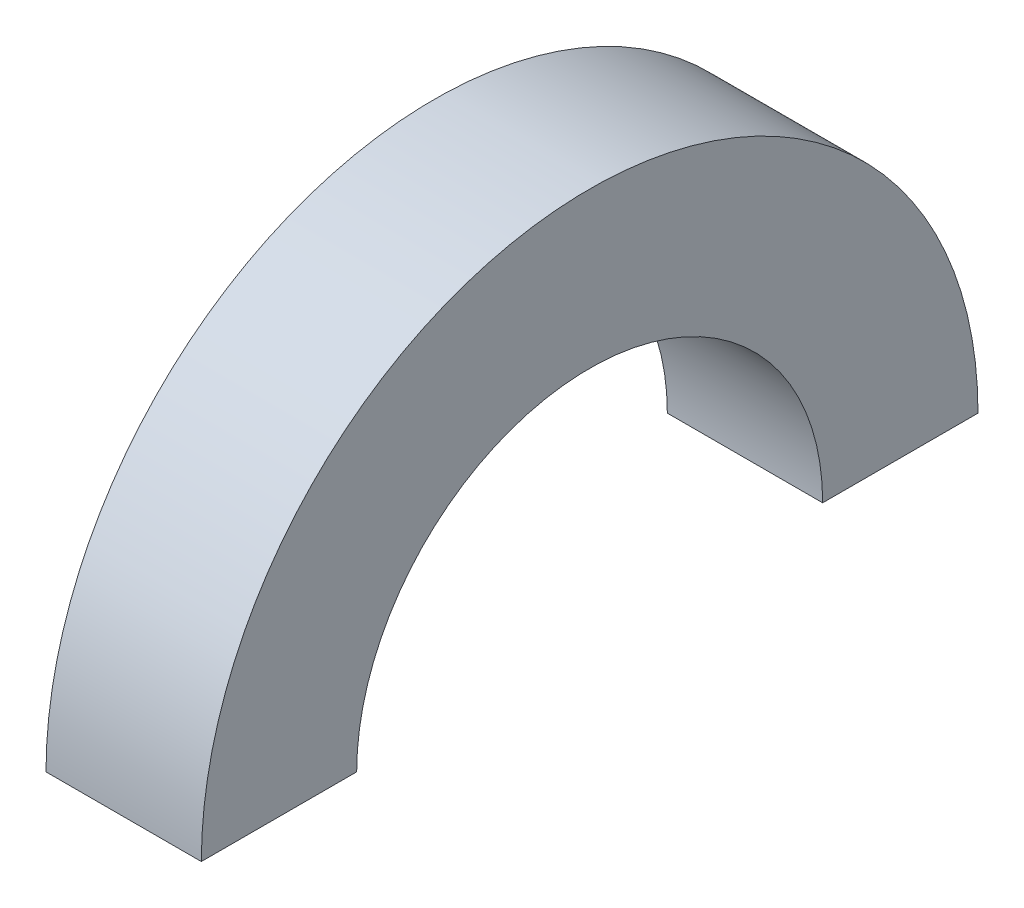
ISO-10303-21;
HEADER;
FILE_DESCRIPTION(('STEP AP214'),'2;1');
FILE_NAME('part.step','',(''),(''),'','','');
FILE_SCHEMA(('AUTOMOTIVE_DESIGN { 1 0 10303 214 1 1 1 1 }'));
ENDSEC;
DATA;
#1=APPLICATION_CONTEXT('core data for automotive mechanical design processes');
#2=APPLICATION_PROTOCOL_DEFINITION('international standard','automotive_design',2000,#1);
#3=PRODUCT_CONTEXT('',#1,'mechanical');
#4=PRODUCT('Part','Part','',(#3));
#5=PRODUCT_RELATED_PRODUCT_CATEGORY('part','',(#4));
#6=PRODUCT_DEFINITION_FORMATION('','',#4);
#7=PRODUCT_DEFINITION_CONTEXT('part definition',#1,'design');
#8=PRODUCT_DEFINITION('design','',#6,#7);
#9=PRODUCT_DEFINITION_SHAPE('','',#8);
#10=(LENGTH_UNIT() NAMED_UNIT(*) SI_UNIT(.MILLI.,.METRE.));
#11=(NAMED_UNIT(*) PLANE_ANGLE_UNIT() SI_UNIT($,.RADIAN.));
#12=(NAMED_UNIT(*) SI_UNIT($,.STERADIAN.) SOLID_ANGLE_UNIT());
#13=UNCERTAINTY_MEASURE_WITH_UNIT(LENGTH_MEASURE(1.E-05),#10,'distance_accuracy_value','');
#14=(GEOMETRIC_REPRESENTATION_CONTEXT(3) GLOBAL_UNCERTAINTY_ASSIGNED_CONTEXT((#13)) GLOBAL_UNIT_ASSIGNED_CONTEXT((#10,
#11,#12)) REPRESENTATION_CONTEXT('',''));
#15=CARTESIAN_POINT('',(0.,0.,0.));
#16=DIRECTION('',(0.,0.,1.));
#17=DIRECTION('',(1.,0.,0.));
#18=AXIS2_PLACEMENT_3D('',#15,#16,#17);
#19=CARTESIAN_POINT('',(20.,0.,-100.));
#20=DIRECTION('',(-1.,0.,0.));
#21=DIRECTION('',(0.,0.,1.));
#22=AXIS2_PLACEMENT_3D('',#19,#20,#21);
#23=PLANE('',#22);
#24=CARTESIAN_POINT('',(20.,0.,-50.));
#25=DIRECTION('',(1.,0.,0.));
#26=DIRECTION('',(0.,0.,-1.));
#27=AXIS2_PLACEMENT_3D('',#24,#25,#26);
#28=CIRCLE('',#27,30.);
#29=CARTESIAN_POINT('',(20.,0.,-80.));
#30=VERTEX_POINT('',#29);
#31=CARTESIAN_POINT('',(20.,0.,-20.));
#32=VERTEX_POINT('',#31);
#33=EDGE_CURVE('E11',#30,#32,#28,.T.);
#34=ORIENTED_EDGE('',*,*,#33,.F.);
#35=DIRECTION('',(0.,0.,1.));
#36=VECTOR('',#35,1.);
#37=CARTESIAN_POINT('',(20.,0.,-100.));
#38=LINE('',#37,#36);
#39=CARTESIAN_POINT('',(20.,0.,-100.));
#40=VERTEX_POINT('',#39);
#41=EDGE_CURVE('E95',#40,#30,#38,.T.);
#42=ORIENTED_EDGE('',*,*,#41,.F.);
#43=CARTESIAN_POINT('',(20.,0.,-50.));
#44=DIRECTION('',(1.,0.,0.));
#45=DIRECTION('',(0.,0.,-1.));
#46=AXIS2_PLACEMENT_3D('',#43,#44,#45);
#47=CIRCLE('',#46,50.);
#48=CARTESIAN_POINT('',(20.,0.,0.));
#49=VERTEX_POINT('',#48);
#50=EDGE_CURVE('E48',#40,#49,#47,.T.);
#51=ORIENTED_EDGE('',*,*,#50,.T.);
#52=DIRECTION('',(0.,0.,-1.));
#53=VECTOR('',#52,1.);
#54=CARTESIAN_POINT('',(20.,0.,0.));
#55=LINE('',#54,#53);
#56=EDGE_CURVE('E84',#49,#32,#55,.T.);
#57=ORIENTED_EDGE('',*,*,#56,.T.);
#58=EDGE_LOOP('',(#34,#42,#51,#57));
#59=FACE_BOUND('',#58,.T.);
#60=ADVANCED_FACE('F33',(#59),#23,.F.);
#61=CARTESIAN_POINT('',(0.,0.,-50.));
#62=DIRECTION('',(1.,0.,0.));
#63=DIRECTION('',(0.,0.,-1.));
#64=AXIS2_PLACEMENT_3D('',#61,#62,#63);
#65=CYLINDRICAL_SURFACE('',#64,30.);
#66=CARTESIAN_POINT('',(0.,0.,-50.));
#67=DIRECTION('',(1.,0.,0.));
#68=DIRECTION('',(0.,0.,-1.));
#69=AXIS2_PLACEMENT_3D('',#66,#67,#68);
#70=CIRCLE('',#69,30.);
#71=CARTESIAN_POINT('',(0.,0.,-80.));
#72=VERTEX_POINT('',#71);
#73=CARTESIAN_POINT('',(0.,0.,-20.));
#74=VERTEX_POINT('',#73);
#75=EDGE_CURVE('E41',#72,#74,#70,.T.);
#76=ORIENTED_EDGE('',*,*,#75,.F.);
#77=DIRECTION('',(-1.,0.,0.));
#78=VECTOR('',#77,1.);
#79=CARTESIAN_POINT('',(20.,0.,-80.));
#80=LINE('',#79,#78);
#81=EDGE_CURVE('E80',#30,#72,#80,.T.);
#82=ORIENTED_EDGE('',*,*,#81,.F.);
#83=ORIENTED_EDGE('',*,*,#33,.T.);
#84=DIRECTION('',(-1.,0.,0.));
#85=VECTOR('',#84,1.);
#86=CARTESIAN_POINT('',(20.,0.,-20.));
#87=LINE('',#86,#85);
#88=EDGE_CURVE('E77',#32,#74,#87,.T.);
#89=ORIENTED_EDGE('',*,*,#88,.T.);
#90=EDGE_LOOP('',(#76,#82,#83,#89));
#91=FACE_BOUND('',#90,.T.);
#92=ADVANCED_FACE('F35',(#91),#65,.F.);
#93=CARTESIAN_POINT('',(0.,0.,-100.));
#94=DIRECTION('',(1.,0.,0.));
#95=DIRECTION('',(0.,0.,-1.));
#96=AXIS2_PLACEMENT_3D('',#93,#94,#95);
#97=PLANE('',#96);
#98=CARTESIAN_POINT('',(0.,0.,-50.));
#99=DIRECTION('',(1.,0.,0.));
#100=DIRECTION('',(0.,0.,-1.));
#101=AXIS2_PLACEMENT_3D('',#98,#99,#100);
#102=CIRCLE('',#101,50.);
#103=CARTESIAN_POINT('',(0.,0.,-100.));
#104=VERTEX_POINT('',#103);
#105=CARTESIAN_POINT('',(0.,0.,0.));
#106=VERTEX_POINT('',#105);
#107=EDGE_CURVE('E56',#104,#106,#102,.T.);
#108=ORIENTED_EDGE('',*,*,#107,.F.);
#109=DIRECTION('',(0.,0.,-1.));
#110=VECTOR('',#109,1.);
#111=CARTESIAN_POINT('',(0.,0.,-100.));
#112=LINE('',#111,#110);
#113=EDGE_CURVE('E98',#72,#104,#112,.T.);
#114=ORIENTED_EDGE('',*,*,#113,.F.);
#115=ORIENTED_EDGE('',*,*,#75,.T.);
#116=DIRECTION('',(0.,0.,1.));
#117=VECTOR('',#116,1.);
#118=CARTESIAN_POINT('',(0.,0.,0.));
#119=LINE('',#118,#117);
#120=EDGE_CURVE('E89',#74,#106,#119,.T.);
#121=ORIENTED_EDGE('',*,*,#120,.T.);
#122=EDGE_LOOP('',(#108,#114,#115,#121));
#123=FACE_BOUND('',#122,.T.);
#124=ADVANCED_FACE('F104',(#123),#97,.F.);
#125=CARTESIAN_POINT('',(0.,0.,-50.));
#126=DIRECTION('',(1.,0.,0.));
#127=DIRECTION('',(0.,0.,-1.));
#128=AXIS2_PLACEMENT_3D('',#125,#126,#127);
#129=CYLINDRICAL_SURFACE('',#128,50.);
#130=DIRECTION('',(1.,0.,0.));
#131=VECTOR('',#130,1.);
#132=CARTESIAN_POINT('',(20.,0.,-100.));
#133=LINE('',#132,#131);
#134=EDGE_CURVE('E100',#104,#40,#133,.T.);
#135=ORIENTED_EDGE('',*,*,#134,.F.);
#136=ORIENTED_EDGE('',*,*,#107,.T.);
#137=DIRECTION('',(1.,0.,0.));
#138=VECTOR('',#137,1.);
#139=CARTESIAN_POINT('',(20.,0.,0.));
#140=LINE('',#139,#138);
#141=EDGE_CURVE('E91',#106,#49,#140,.T.);
#142=ORIENTED_EDGE('',*,*,#141,.T.);
#143=ORIENTED_EDGE('',*,*,#50,.F.);
#144=EDGE_LOOP('',(#135,#136,#142,#143));
#145=FACE_BOUND('',#144,.T.);
#146=ADVANCED_FACE('F107',(#145),#129,.T.);
#147=CARTESIAN_POINT('',(20.,0.,-100.));
#148=DIRECTION('',(0.,-1.,0.));
#149=DIRECTION('',(0.,0.,-1.));
#150=AXIS2_PLACEMENT_3D('',#147,#148,#149);
#151=PLANE('',#150);
#152=ORIENTED_EDGE('',*,*,#41,.T.);
#153=ORIENTED_EDGE('',*,*,#81,.T.);
#154=ORIENTED_EDGE('',*,*,#113,.T.);
#155=ORIENTED_EDGE('',*,*,#134,.T.);
#156=EDGE_LOOP('',(#152,#153,#154,#155));
#157=FACE_BOUND('',#156,.T.);
#158=ADVANCED_FACE('F106',(#157),#151,.T.);
#159=CARTESIAN_POINT('',(20.,0.,0.));
#160=DIRECTION('',(0.,1.,0.));
#161=DIRECTION('',(0.,0.,1.));
#162=AXIS2_PLACEMENT_3D('',#159,#160,#161);
#163=PLANE('',#162);
#164=ORIENTED_EDGE('',*,*,#56,.F.);
#165=ORIENTED_EDGE('',*,*,#141,.F.);
#166=ORIENTED_EDGE('',*,*,#120,.F.);
#167=ORIENTED_EDGE('',*,*,#88,.F.);
#168=EDGE_LOOP('',(#164,#165,#166,#167));
#169=FACE_BOUND('',#168,.T.);
#170=ADVANCED_FACE('F88',(#169),#163,.F.);
#171=CLOSED_SHELL('',(#60,#92,#124,#146,#158,#170));
#172=MANIFOLD_SOLID_BREP('B2',#171);
#173=ADVANCED_BREP_SHAPE_REPRESENTATION('',(#18,#172),#14);
#174=SHAPE_DEFINITION_REPRESENTATION(#9,#173);
ENDSEC;
END-ISO-10303-21;
